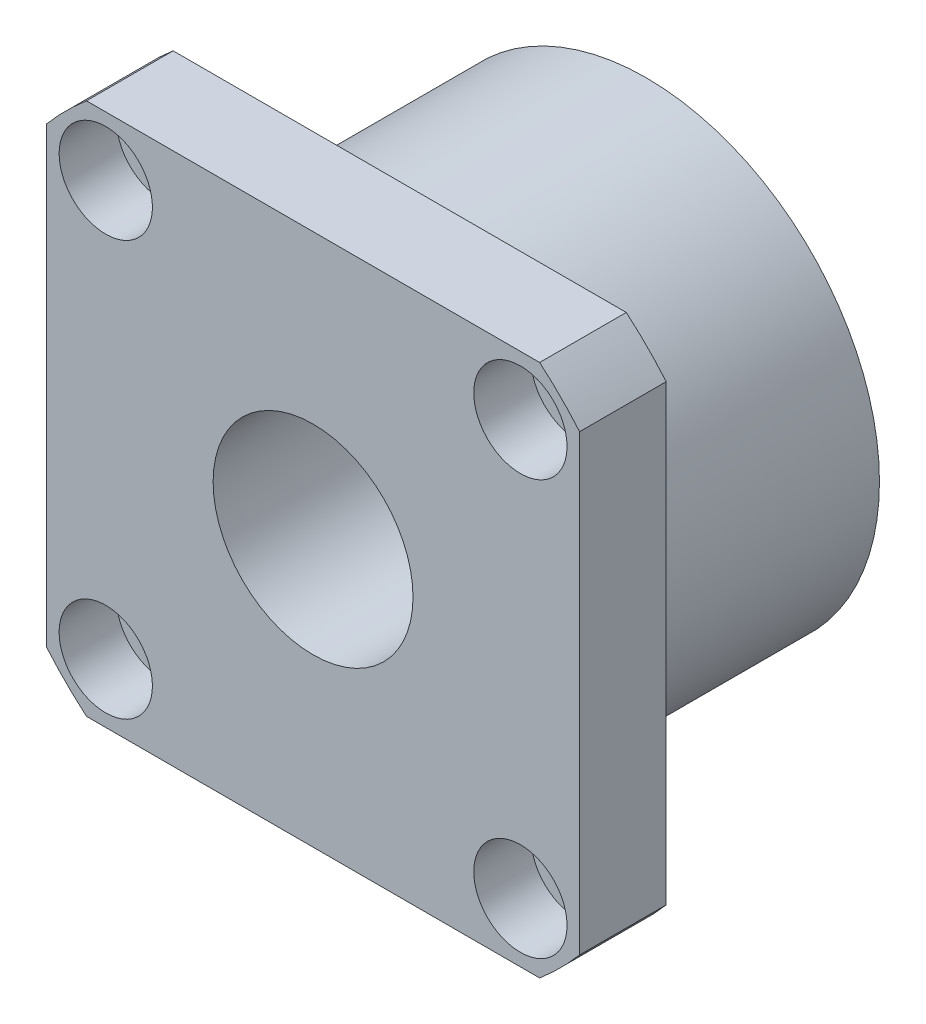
ISO-10303-21;
HEADER;
FILE_DESCRIPTION(('STEP AP214'),'2;1');
FILE_NAME('part.step','',(''),(''),'','','');
FILE_SCHEMA(('AUTOMOTIVE_DESIGN { 1 0 10303 214 1 1 1 1 }'));
ENDSEC;
DATA;
#1=APPLICATION_CONTEXT('core data for automotive mechanical design processes');
#2=APPLICATION_PROTOCOL_DEFINITION('international standard','automotive_design',2000,#1);
#3=PRODUCT_CONTEXT('',#1,'mechanical');
#4=PRODUCT('Part','Part','',(#3));
#5=PRODUCT_RELATED_PRODUCT_CATEGORY('part','',(#4));
#6=PRODUCT_DEFINITION_FORMATION('','',#4);
#7=PRODUCT_DEFINITION_CONTEXT('part definition',#1,'design');
#8=PRODUCT_DEFINITION('design','',#6,#7);
#9=PRODUCT_DEFINITION_SHAPE('','',#8);
#10=(LENGTH_UNIT() NAMED_UNIT(*) SI_UNIT(.MILLI.,.METRE.));
#11=(NAMED_UNIT(*) PLANE_ANGLE_UNIT() SI_UNIT($,.RADIAN.));
#12=(NAMED_UNIT(*) SI_UNIT($,.STERADIAN.) SOLID_ANGLE_UNIT());
#13=UNCERTAINTY_MEASURE_WITH_UNIT(LENGTH_MEASURE(1.E-05),#10,'distance_accuracy_value','');
#14=(GEOMETRIC_REPRESENTATION_CONTEXT(3) GLOBAL_UNCERTAINTY_ASSIGNED_CONTEXT((#13)) GLOBAL_UNIT_ASSIGNED_CONTEXT((#10,
#11,#12)) REPRESENTATION_CONTEXT('',''));
#15=CARTESIAN_POINT('',(0.,0.,0.));
#16=DIRECTION('',(0.,0.,1.));
#17=DIRECTION('',(1.,0.,0.));
#18=AXIS2_PLACEMENT_3D('',#15,#16,#17);
#19=CARTESIAN_POINT('',(0.,0.,0.));
#20=DIRECTION('',(0.,0.,-1.));
#21=DIRECTION('',(-1.,0.,0.));
#22=AXIS2_PLACEMENT_3D('',#19,#20,#21);
#23=PLANE('',#22);
#24=CARTESIAN_POINT('',(-31.1126983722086,-31.1126983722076,0.));
#25=DIRECTION('',(0.,0.,-1.));
#26=DIRECTION('',(0.,-1.,0.));
#27=AXIS2_PLACEMENT_3D('',#24,#25,#26);
#28=CIRCLE('',#27,5.);
#29=CARTESIAN_POINT('',(-31.1126983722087,-36.1126983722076,0.));
#30=VERTEX_POINT('',#29);
#31=EDGE_CURVE('E156',#30,#30,#28,.T.);
#32=ORIENTED_EDGE('',*,*,#31,.F.);
#33=EDGE_LOOP('',(#32));
#34=FACE_BOUND('',#33,.T.);
#35=CARTESIAN_POINT('',(31.1126983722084,31.1126983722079,0.));
#36=DIRECTION('',(0.,0.,-1.));
#37=DIRECTION('',(0.,1.,0.));
#38=AXIS2_PLACEMENT_3D('',#35,#36,#37);
#39=CIRCLE('',#38,5.);
#40=CARTESIAN_POINT('',(31.1126983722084,36.1126983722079,0.));
#41=VERTEX_POINT('',#40);
#42=EDGE_CURVE('E190',#41,#41,#39,.T.);
#43=ORIENTED_EDGE('',*,*,#42,.F.);
#44=EDGE_LOOP('',(#43));
#45=FACE_BOUND('',#44,.T.);
#46=CARTESIAN_POINT('',(0.,0.,0.));
#47=DIRECTION('',(0.,0.,-1.));
#48=DIRECTION('',(-1.,0.,0.));
#49=AXIS2_PLACEMENT_3D('',#46,#47,#48);
#50=CIRCLE('',#49,52.5);
#51=CARTESIAN_POINT('',(40.,-34.0036762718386,0.));
#52=VERTEX_POINT('',#51);
#53=CARTESIAN_POINT('',(34.0036762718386,-40.,0.));
#54=VERTEX_POINT('',#53);
#55=EDGE_CURVE('E80',#52,#54,#50,.T.);
#56=ORIENTED_EDGE('',*,*,#55,.T.);
#57=DIRECTION('',(1.,0.,0.));
#58=VECTOR('',#57,1.);
#59=CARTESIAN_POINT('',(-34.0036762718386,-40.,0.));
#60=LINE('',#59,#58);
#61=CARTESIAN_POINT('',(-34.0036762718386,-40.,0.));
#62=VERTEX_POINT('',#61);
#63=EDGE_CURVE('E94',#62,#54,#60,.T.);
#64=ORIENTED_EDGE('',*,*,#63,.F.);
#65=CARTESIAN_POINT('',(0.,0.,0.));
#66=DIRECTION('',(0.,0.,1.));
#67=DIRECTION('',(1.,0.,0.));
#68=AXIS2_PLACEMENT_3D('',#65,#66,#67);
#69=CIRCLE('',#68,52.5);
#70=CARTESIAN_POINT('',(-40.,-34.0036762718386,0.));
#71=VERTEX_POINT('',#70);
#72=EDGE_CURVE('E101',#71,#62,#69,.T.);
#73=ORIENTED_EDGE('',*,*,#72,.F.);
#74=DIRECTION('',(0.,-1.,0.));
#75=VECTOR('',#74,1.);
#76=CARTESIAN_POINT('',(-40.,34.0036762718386,0.));
#77=LINE('',#76,#75);
#78=CARTESIAN_POINT('',(-40.,34.0036762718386,0.));
#79=VERTEX_POINT('',#78);
#80=EDGE_CURVE('E103',#79,#71,#77,.T.);
#81=ORIENTED_EDGE('',*,*,#80,.F.);
#82=CARTESIAN_POINT('',(0.,0.,0.));
#83=DIRECTION('',(0.,0.,-1.));
#84=DIRECTION('',(-1.,0.,0.));
#85=AXIS2_PLACEMENT_3D('',#82,#83,#84);
#86=CIRCLE('',#85,52.5);
#87=CARTESIAN_POINT('',(-34.0036762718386,40.,0.));
#88=VERTEX_POINT('',#87);
#89=EDGE_CURVE('E109',#79,#88,#86,.T.);
#90=ORIENTED_EDGE('',*,*,#89,.T.);
#91=DIRECTION('',(1.,0.,0.));
#92=VECTOR('',#91,1.);
#93=CARTESIAN_POINT('',(-34.0036762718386,40.,0.));
#94=LINE('',#93,#92);
#95=CARTESIAN_POINT('',(34.0036762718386,40.,0.));
#96=VERTEX_POINT('',#95);
#97=EDGE_CURVE('E112',#88,#96,#94,.T.);
#98=ORIENTED_EDGE('',*,*,#97,.T.);
#99=CARTESIAN_POINT('',(0.,0.,0.));
#100=DIRECTION('',(0.,0.,1.));
#101=DIRECTION('',(1.,0.,0.));
#102=AXIS2_PLACEMENT_3D('',#99,#100,#101);
#103=CIRCLE('',#102,52.5);
#104=CARTESIAN_POINT('',(40.,34.0036762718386,0.));
#105=VERTEX_POINT('',#104);
#106=EDGE_CURVE('E115',#105,#96,#103,.T.);
#107=ORIENTED_EDGE('',*,*,#106,.F.);
#108=DIRECTION('',(0.,-1.,0.));
#109=VECTOR('',#108,1.);
#110=CARTESIAN_POINT('',(40.,34.0036762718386,0.));
#111=LINE('',#110,#109);
#112=EDGE_CURVE('E97',#105,#52,#111,.T.);
#113=ORIENTED_EDGE('',*,*,#112,.T.);
#114=EDGE_LOOP('',(#56,#64,#73,#81,#90,#98,#107,#113));
#115=FACE_BOUND('',#114,.T.);
#116=CARTESIAN_POINT('',(-31.112698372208,31.1126983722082,0.));
#117=DIRECTION('',(0.,0.,-1.));
#118=DIRECTION('',(-1.,0.,0.));
#119=AXIS2_PLACEMENT_3D('',#116,#117,#118);
#120=CIRCLE('',#119,5.);
#121=CARTESIAN_POINT('',(-36.112698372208,31.1126983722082,0.));
#122=VERTEX_POINT('',#121);
#123=EDGE_CURVE('E151',#122,#122,#120,.T.);
#124=ORIENTED_EDGE('',*,*,#123,.F.);
#125=EDGE_LOOP('',(#124));
#126=FACE_BOUND('',#125,.T.);
#127=CARTESIAN_POINT('',(31.1126983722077,-31.1126983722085,0.));
#128=DIRECTION('',(0.,0.,-1.));
#129=DIRECTION('',(1.,0.,0.));
#130=AXIS2_PLACEMENT_3D('',#127,#128,#129);
#131=CIRCLE('',#130,5.);
#132=CARTESIAN_POINT('',(36.1126983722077,-31.1126983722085,0.));
#133=VERTEX_POINT('',#132);
#134=EDGE_CURVE('E187',#133,#133,#131,.T.);
#135=ORIENTED_EDGE('',*,*,#134,.F.);
#136=EDGE_LOOP('',(#135));
#137=FACE_BOUND('',#136,.T.);
#138=CARTESIAN_POINT('',(0.,0.,0.));
#139=DIRECTION('',(0.,0.,-1.));
#140=DIRECTION('',(-1.,0.,0.));
#141=AXIS2_PLACEMENT_3D('',#138,#139,#140);
#142=CIRCLE('',#141,35.);
#143=CARTESIAN_POINT('',(-35.,0.,0.));
#144=VERTEX_POINT('',#143);
#145=EDGE_CURVE('E18',#144,#144,#142,.F.);
#146=ORIENTED_EDGE('',*,*,#145,.T.);
#147=EDGE_LOOP('',(#146));
#148=FACE_BOUND('',#147,.T.);
#149=ADVANCED_FACE('F14',(#34,#45,#115,#126,#137,#148),#23,.T.);
#150=CARTESIAN_POINT('',(0.,0.,13.));
#151=DIRECTION('',(0.,0.,-1.));
#152=DIRECTION('',(-1.,0.,0.));
#153=AXIS2_PLACEMENT_3D('',#150,#151,#152);
#154=PLANE('',#153);
#155=CARTESIAN_POINT('',(0.,0.,13.));
#156=DIRECTION('',(0.,0.,1.));
#157=DIRECTION('',(1.,0.,0.));
#158=AXIS2_PLACEMENT_3D('',#155,#156,#157);
#159=CIRCLE('',#158,15.);
#160=CARTESIAN_POINT('',(15.,0.,13.));
#161=VERTEX_POINT('',#160);
#162=EDGE_CURVE('E98',#161,#161,#159,.T.);
#163=ORIENTED_EDGE('',*,*,#162,.F.);
#164=EDGE_LOOP('',(#163));
#165=FACE_BOUND('',#164,.T.);
#166=CARTESIAN_POINT('',(-31.1126983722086,-31.1126983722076,13.));
#167=DIRECTION('',(0.,0.,-1.));
#168=DIRECTION('',(0.,-1.,0.));
#169=AXIS2_PLACEMENT_3D('',#166,#167,#168);
#170=CIRCLE('',#169,7.);
#171=CARTESIAN_POINT('',(-31.1126983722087,-38.1126983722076,13.));
#172=VERTEX_POINT('',#171);
#173=EDGE_CURVE('E171',#172,#172,#170,.T.);
#174=ORIENTED_EDGE('',*,*,#173,.T.);
#175=EDGE_LOOP('',(#174));
#176=FACE_BOUND('',#175,.T.);
#177=CARTESIAN_POINT('',(31.1126983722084,31.1126983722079,13.));
#178=DIRECTION('',(0.,0.,-1.));
#179=DIRECTION('',(0.,1.,0.));
#180=AXIS2_PLACEMENT_3D('',#177,#178,#179);
#181=CIRCLE('',#180,7.);
#182=CARTESIAN_POINT('',(31.1126983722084,38.1126983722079,13.));
#183=VERTEX_POINT('',#182);
#184=EDGE_CURVE('E160',#183,#183,#181,.T.);
#185=ORIENTED_EDGE('',*,*,#184,.T.);
#186=EDGE_LOOP('',(#185));
#187=FACE_BOUND('',#186,.T.);
#188=CARTESIAN_POINT('',(-31.112698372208,31.1126983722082,13.));
#189=DIRECTION('',(0.,0.,-1.));
#190=DIRECTION('',(-1.,0.,0.));
#191=AXIS2_PLACEMENT_3D('',#188,#189,#190);
#192=CIRCLE('',#191,7.);
#193=CARTESIAN_POINT('',(-38.112698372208,31.1126983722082,13.));
#194=VERTEX_POINT('',#193);
#195=EDGE_CURVE('E193',#194,#194,#192,.T.);
#196=ORIENTED_EDGE('',*,*,#195,.T.);
#197=EDGE_LOOP('',(#196));
#198=FACE_BOUND('',#197,.T.);
#199=CARTESIAN_POINT('',(0.,0.,13.));
#200=DIRECTION('',(0.,0.,-1.));
#201=DIRECTION('',(-1.,0.,0.));
#202=AXIS2_PLACEMENT_3D('',#199,#200,#201);
#203=CIRCLE('',#202,52.5);
#204=CARTESIAN_POINT('',(40.,-34.0036762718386,13.));
#205=VERTEX_POINT('',#204);
#206=CARTESIAN_POINT('',(34.0036762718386,-40.,13.));
#207=VERTEX_POINT('',#206);
#208=EDGE_CURVE('E82',#205,#207,#203,.T.);
#209=ORIENTED_EDGE('',*,*,#208,.F.);
#210=DIRECTION('',(0.,-1.,0.));
#211=VECTOR('',#210,1.);
#212=CARTESIAN_POINT('',(40.,34.0036762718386,13.));
#213=LINE('',#212,#211);
#214=CARTESIAN_POINT('',(40.,34.0036762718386,13.));
#215=VERTEX_POINT('',#214);
#216=EDGE_CURVE('E88',#215,#205,#213,.T.);
#217=ORIENTED_EDGE('',*,*,#216,.F.);
#218=CARTESIAN_POINT('',(0.,0.,13.));
#219=DIRECTION('',(0.,0.,1.));
#220=DIRECTION('',(1.,0.,0.));
#221=AXIS2_PLACEMENT_3D('',#218,#219,#220);
#222=CIRCLE('',#221,52.5);
#223=CARTESIAN_POINT('',(34.0036762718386,40.,13.));
#224=VERTEX_POINT('',#223);
#225=EDGE_CURVE('E134',#215,#224,#222,.T.);
#226=ORIENTED_EDGE('',*,*,#225,.T.);
#227=DIRECTION('',(1.,0.,0.));
#228=VECTOR('',#227,1.);
#229=CARTESIAN_POINT('',(-34.0036762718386,40.,13.));
#230=LINE('',#229,#228);
#231=CARTESIAN_POINT('',(-34.0036762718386,40.,13.));
#232=VERTEX_POINT('',#231);
#233=EDGE_CURVE('E131',#232,#224,#230,.T.);
#234=ORIENTED_EDGE('',*,*,#233,.F.);
#235=CARTESIAN_POINT('',(0.,0.,13.));
#236=DIRECTION('',(0.,0.,-1.));
#237=DIRECTION('',(-1.,0.,0.));
#238=AXIS2_PLACEMENT_3D('',#235,#236,#237);
#239=CIRCLE('',#238,52.5);
#240=CARTESIAN_POINT('',(-40.,34.0036762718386,13.));
#241=VERTEX_POINT('',#240);
#242=EDGE_CURVE('E128',#241,#232,#239,.T.);
#243=ORIENTED_EDGE('',*,*,#242,.F.);
#244=DIRECTION('',(0.,-1.,0.));
#245=VECTOR('',#244,1.);
#246=CARTESIAN_POINT('',(-40.,34.0036762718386,13.));
#247=LINE('',#246,#245);
#248=CARTESIAN_POINT('',(-40.,-34.0036762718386,13.));
#249=VERTEX_POINT('',#248);
#250=EDGE_CURVE('E125',#241,#249,#247,.T.);
#251=ORIENTED_EDGE('',*,*,#250,.T.);
#252=CARTESIAN_POINT('',(0.,0.,13.));
#253=DIRECTION('',(0.,0.,1.));
#254=DIRECTION('',(1.,0.,0.));
#255=AXIS2_PLACEMENT_3D('',#252,#253,#254);
#256=CIRCLE('',#255,52.5);
#257=CARTESIAN_POINT('',(-34.0036762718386,-40.,13.));
#258=VERTEX_POINT('',#257);
#259=EDGE_CURVE('E122',#249,#258,#256,.T.);
#260=ORIENTED_EDGE('',*,*,#259,.T.);
#261=DIRECTION('',(1.,0.,0.));
#262=VECTOR('',#261,1.);
#263=CARTESIAN_POINT('',(-34.0036762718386,-40.,13.));
#264=LINE('',#263,#262);
#265=EDGE_CURVE('E120',#258,#207,#264,.T.);
#266=ORIENTED_EDGE('',*,*,#265,.T.);
#267=EDGE_LOOP('',(#209,#217,#226,#234,#243,#251,#260,#266));
#268=FACE_BOUND('',#267,.T.);
#269=CARTESIAN_POINT('',(31.1126983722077,-31.1126983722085,13.));
#270=DIRECTION('',(0.,0.,-1.));
#271=DIRECTION('',(1.,0.,0.));
#272=AXIS2_PLACEMENT_3D('',#269,#270,#271);
#273=CIRCLE('',#272,7.);
#274=CARTESIAN_POINT('',(38.1126983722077,-31.1126983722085,13.));
#275=VERTEX_POINT('',#274);
#276=EDGE_CURVE('E164',#275,#275,#273,.T.);
#277=ORIENTED_EDGE('',*,*,#276,.T.);
#278=EDGE_LOOP('',(#277));
#279=FACE_BOUND('',#278,.T.);
#280=ADVANCED_FACE('F205',(#165,#176,#187,#198,#268,#279),#154,.F.);
#281=CARTESIAN_POINT('',(0.,0.,13.));
#282=DIRECTION('',(0.,0.,-1.));
#283=DIRECTION('',(-1.,0.,0.));
#284=AXIS2_PLACEMENT_3D('',#281,#282,#283);
#285=CYLINDRICAL_SURFACE('',#284,52.5);
#286=DIRECTION('',(0.,0.,-1.));
#287=VECTOR('',#286,1.);
#288=CARTESIAN_POINT('',(40.,-34.0036762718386,13.));
#289=LINE('',#288,#287);
#290=EDGE_CURVE('E9',#205,#52,#289,.T.);
#291=ORIENTED_EDGE('',*,*,#290,.F.);
#292=ORIENTED_EDGE('',*,*,#208,.T.);
#293=DIRECTION('',(0.,0.,-1.));
#294=VECTOR('',#293,1.);
#295=CARTESIAN_POINT('',(34.0036762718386,-40.,13.));
#296=LINE('',#295,#294);
#297=EDGE_CURVE('E77',#207,#54,#296,.T.);
#298=ORIENTED_EDGE('',*,*,#297,.T.);
#299=ORIENTED_EDGE('',*,*,#55,.F.);
#300=EDGE_LOOP('',(#291,#292,#298,#299));
#301=FACE_BOUND('',#300,.T.);
#302=ADVANCED_FACE('F79',(#301),#285,.T.);
#303=CARTESIAN_POINT('',(40.,34.0036762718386,13.));
#304=DIRECTION('',(1.,0.,0.));
#305=DIRECTION('',(0.,0.,-1.));
#306=AXIS2_PLACEMENT_3D('',#303,#304,#305);
#307=PLANE('',#306);
#308=DIRECTION('',(0.,0.,-1.));
#309=VECTOR('',#308,1.);
#310=CARTESIAN_POINT('',(40.,34.0036762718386,13.));
#311=LINE('',#310,#309);
#312=EDGE_CURVE('E23',#215,#105,#311,.T.);
#313=ORIENTED_EDGE('',*,*,#312,.F.);
#314=ORIENTED_EDGE('',*,*,#216,.T.);
#315=ORIENTED_EDGE('',*,*,#290,.T.);
#316=ORIENTED_EDGE('',*,*,#112,.F.);
#317=EDGE_LOOP('',(#313,#314,#315,#316));
#318=FACE_BOUND('',#317,.T.);
#319=ADVANCED_FACE('F16',(#318),#307,.T.);
#320=CARTESIAN_POINT('',(0.,0.,13.));
#321=DIRECTION('',(0.,0.,-1.));
#322=DIRECTION('',(-1.,0.,0.));
#323=AXIS2_PLACEMENT_3D('',#320,#321,#322);
#324=CYLINDRICAL_SURFACE('',#323,52.5);
#325=DIRECTION('',(0.,0.,-1.));
#326=VECTOR('',#325,1.);
#327=CARTESIAN_POINT('',(34.0036762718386,40.,13.));
#328=LINE('',#327,#326);
#329=EDGE_CURVE('E145',#224,#96,#328,.T.);
#330=ORIENTED_EDGE('',*,*,#329,.F.);
#331=ORIENTED_EDGE('',*,*,#225,.F.);
#332=ORIENTED_EDGE('',*,*,#312,.T.);
#333=ORIENTED_EDGE('',*,*,#106,.T.);
#334=EDGE_LOOP('',(#330,#331,#332,#333));
#335=FACE_BOUND('',#334,.T.);
#336=ADVANCED_FACE('F269',(#335),#324,.T.);
#337=CARTESIAN_POINT('',(-34.0036762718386,40.,13.));
#338=DIRECTION('',(0.,1.,0.));
#339=DIRECTION('',(0.,0.,1.));
#340=AXIS2_PLACEMENT_3D('',#337,#338,#339);
#341=PLANE('',#340);
#342=DIRECTION('',(0.,0.,-1.));
#343=VECTOR('',#342,1.);
#344=CARTESIAN_POINT('',(-34.0036762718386,40.,13.));
#345=LINE('',#344,#343);
#346=EDGE_CURVE('E143',#232,#88,#345,.T.);
#347=ORIENTED_EDGE('',*,*,#346,.F.);
#348=ORIENTED_EDGE('',*,*,#233,.T.);
#349=ORIENTED_EDGE('',*,*,#329,.T.);
#350=ORIENTED_EDGE('',*,*,#97,.F.);
#351=EDGE_LOOP('',(#347,#348,#349,#350));
#352=FACE_BOUND('',#351,.T.);
#353=ADVANCED_FACE('F266',(#352),#341,.T.);
#354=CARTESIAN_POINT('',(0.,0.,13.));
#355=DIRECTION('',(0.,0.,-1.));
#356=DIRECTION('',(-1.,0.,0.));
#357=AXIS2_PLACEMENT_3D('',#354,#355,#356);
#358=CYLINDRICAL_SURFACE('',#357,52.5);
#359=DIRECTION('',(0.,0.,-1.));
#360=VECTOR('',#359,1.);
#361=CARTESIAN_POINT('',(-40.,34.0036762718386,13.));
#362=LINE('',#361,#360);
#363=EDGE_CURVE('E141',#241,#79,#362,.T.);
#364=ORIENTED_EDGE('',*,*,#363,.F.);
#365=ORIENTED_EDGE('',*,*,#242,.T.);
#366=ORIENTED_EDGE('',*,*,#346,.T.);
#367=ORIENTED_EDGE('',*,*,#89,.F.);
#368=EDGE_LOOP('',(#364,#365,#366,#367));
#369=FACE_BOUND('',#368,.T.);
#370=ADVANCED_FACE('F262',(#369),#358,.T.);
#371=CARTESIAN_POINT('',(-40.,34.0036762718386,13.));
#372=DIRECTION('',(1.,0.,0.));
#373=DIRECTION('',(0.,0.,-1.));
#374=AXIS2_PLACEMENT_3D('',#371,#372,#373);
#375=PLANE('',#374);
#376=DIRECTION('',(0.,0.,-1.));
#377=VECTOR('',#376,1.);
#378=CARTESIAN_POINT('',(-40.,-34.0036762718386,13.));
#379=LINE('',#378,#377);
#380=EDGE_CURVE('E139',#249,#71,#379,.T.);
#381=ORIENTED_EDGE('',*,*,#380,.F.);
#382=ORIENTED_EDGE('',*,*,#250,.F.);
#383=ORIENTED_EDGE('',*,*,#363,.T.);
#384=ORIENTED_EDGE('',*,*,#80,.T.);
#385=EDGE_LOOP('',(#381,#382,#383,#384));
#386=FACE_BOUND('',#385,.T.);
#387=ADVANCED_FACE('F258',(#386),#375,.F.);
#388=CARTESIAN_POINT('',(0.,0.,13.));
#389=DIRECTION('',(0.,0.,-1.));
#390=DIRECTION('',(-1.,0.,0.));
#391=AXIS2_PLACEMENT_3D('',#388,#389,#390);
#392=CYLINDRICAL_SURFACE('',#391,52.5);
#393=DIRECTION('',(0.,0.,-1.));
#394=VECTOR('',#393,1.);
#395=CARTESIAN_POINT('',(-34.0036762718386,-40.,13.));
#396=LINE('',#395,#394);
#397=EDGE_CURVE('E87',#258,#62,#396,.T.);
#398=ORIENTED_EDGE('',*,*,#397,.F.);
#399=ORIENTED_EDGE('',*,*,#259,.F.);
#400=ORIENTED_EDGE('',*,*,#380,.T.);
#401=ORIENTED_EDGE('',*,*,#72,.T.);
#402=EDGE_LOOP('',(#398,#399,#400,#401));
#403=FACE_BOUND('',#402,.T.);
#404=ADVANCED_FACE('F255',(#403),#392,.T.);
#405=CARTESIAN_POINT('',(-34.0036762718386,-40.,13.));
#406=DIRECTION('',(0.,1.,0.));
#407=DIRECTION('',(0.,0.,1.));
#408=AXIS2_PLACEMENT_3D('',#405,#406,#407);
#409=PLANE('',#408);
#410=ORIENTED_EDGE('',*,*,#265,.F.);
#411=ORIENTED_EDGE('',*,*,#397,.T.);
#412=ORIENTED_EDGE('',*,*,#63,.T.);
#413=ORIENTED_EDGE('',*,*,#297,.F.);
#414=EDGE_LOOP('',(#410,#411,#412,#413));
#415=FACE_BOUND('',#414,.T.);
#416=ADVANCED_FACE('F100',(#415),#409,.F.);
#417=CARTESIAN_POINT('',(0.,0.,13.));
#418=DIRECTION('',(0.,0.,-1.));
#419=DIRECTION('',(-1.,0.,0.));
#420=AXIS2_PLACEMENT_3D('',#417,#418,#419);
#421=CYLINDRICAL_SURFACE('',#420,15.);
#422=ORIENTED_EDGE('',*,*,#162,.T.);
#423=EDGE_LOOP('',(#422));
#424=FACE_BOUND('',#423,.T.);
#425=CARTESIAN_POINT('',(0.,0.,-37.));
#426=DIRECTION('',(0.,0.,-1.));
#427=DIRECTION('',(-1.,0.,0.));
#428=AXIS2_PLACEMENT_3D('',#425,#426,#427);
#429=CIRCLE('',#428,15.);
#430=CARTESIAN_POINT('',(-15.,0.,-37.));
#431=VERTEX_POINT('',#430);
#432=EDGE_CURVE('E475',#431,#431,#429,.T.);
#433=ORIENTED_EDGE('',*,*,#432,.T.);
#434=EDGE_LOOP('',(#433));
#435=FACE_BOUND('',#434,.T.);
#436=ADVANCED_FACE('F202',(#424,#435),#421,.F.);
#437=CARTESIAN_POINT('',(-31.112698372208,31.1126983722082,0.));
#438=DIRECTION('',(0.,0.,1.));
#439=DIRECTION('',(1.,0.,0.));
#440=AXIS2_PLACEMENT_3D('',#437,#438,#439);
#441=CYLINDRICAL_SURFACE('',#440,5.);
#442=CARTESIAN_POINT('',(-31.112698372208,31.1126983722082,4.4));
#443=DIRECTION('',(0.,0.,-1.));
#444=DIRECTION('',(-1.,0.,0.));
#445=AXIS2_PLACEMENT_3D('',#442,#443,#444);
#446=CIRCLE('',#445,5.);
#447=CARTESIAN_POINT('',(-36.112698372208,31.1126983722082,4.4));
#448=VERTEX_POINT('',#447);
#449=EDGE_CURVE('E148',#448,#448,#446,.T.);
#450=ORIENTED_EDGE('',*,*,#449,.F.);
#451=EDGE_LOOP('',(#450));
#452=FACE_BOUND('',#451,.T.);
#453=ORIENTED_EDGE('',*,*,#123,.T.);
#454=EDGE_LOOP('',(#453));
#455=FACE_BOUND('',#454,.T.);
#456=ADVANCED_FACE('F351',(#452,#455),#441,.F.);
#457=CARTESIAN_POINT('',(-31.112698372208,31.1126983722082,4.4));
#458=DIRECTION('',(0.,0.,1.));
#459=DIRECTION('',(1.,0.,0.));
#460=AXIS2_PLACEMENT_3D('',#457,#458,#459);
#461=CYLINDRICAL_SURFACE('',#460,7.);
#462=CARTESIAN_POINT('',(-31.112698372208,31.1126983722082,4.4));
#463=DIRECTION('',(0.,0.,-1.));
#464=DIRECTION('',(-1.,0.,0.));
#465=AXIS2_PLACEMENT_3D('',#462,#463,#464);
#466=CIRCLE('',#465,7.);
#467=CARTESIAN_POINT('',(-38.112698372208,31.1126983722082,4.4));
#468=VERTEX_POINT('',#467);
#469=EDGE_CURVE('E152',#468,#468,#466,.T.);
#470=ORIENTED_EDGE('',*,*,#469,.T.);
#471=EDGE_LOOP('',(#470));
#472=FACE_BOUND('',#471,.T.);
#473=ORIENTED_EDGE('',*,*,#195,.F.);
#474=EDGE_LOOP('',(#473));
#475=FACE_BOUND('',#474,.T.);
#476=ADVANCED_FACE('F358',(#472,#475),#461,.F.);
#477=CARTESIAN_POINT('',(-31.112698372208,31.1126983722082,4.4));
#478=DIRECTION('',(0.,0.,-1.));
#479=DIRECTION('',(-1.,0.,0.));
#480=AXIS2_PLACEMENT_3D('',#477,#478,#479);
#481=PLANE('',#480);
#482=ORIENTED_EDGE('',*,*,#449,.T.);
#483=EDGE_LOOP('',(#482));
#484=FACE_BOUND('',#483,.T.);
#485=ORIENTED_EDGE('',*,*,#469,.F.);
#486=EDGE_LOOP('',(#485));
#487=FACE_BOUND('',#486,.T.);
#488=ADVANCED_FACE('F360',(#484,#487),#481,.F.);
#489=CARTESIAN_POINT('',(31.1126983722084,31.1126983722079,0.));
#490=DIRECTION('',(0.,0.,1.));
#491=DIRECTION('',(1.,0.,0.));
#492=AXIS2_PLACEMENT_3D('',#489,#490,#491);
#493=CYLINDRICAL_SURFACE('',#492,5.);
#494=CARTESIAN_POINT('',(31.1126983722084,31.1126983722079,4.4));
#495=DIRECTION('',(0.,0.,-1.));
#496=DIRECTION('',(-1.,0.,0.));
#497=AXIS2_PLACEMENT_3D('',#494,#495,#496);
#498=CIRCLE('',#497,5.);
#499=CARTESIAN_POINT('',(26.1126983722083,31.1126983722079,4.4));
#500=VERTEX_POINT('',#499);
#501=EDGE_CURVE('E153',#500,#500,#498,.T.);
#502=ORIENTED_EDGE('',*,*,#501,.F.);
#503=EDGE_LOOP('',(#502));
#504=FACE_BOUND('',#503,.T.);
#505=ORIENTED_EDGE('',*,*,#42,.T.);
#506=EDGE_LOOP('',(#505));
#507=FACE_BOUND('',#506,.T.);
#508=ADVANCED_FACE('F369',(#504,#507),#493,.F.);
#509=CARTESIAN_POINT('',(31.1126983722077,-31.1126983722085,0.));
#510=DIRECTION('',(0.,0.,1.));
#511=DIRECTION('',(1.,0.,0.));
#512=AXIS2_PLACEMENT_3D('',#509,#510,#511);
#513=CYLINDRICAL_SURFACE('',#512,5.);
#514=CARTESIAN_POINT('',(31.1126983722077,-31.1126983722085,4.4));
#515=DIRECTION('',(0.,0.,-1.));
#516=DIRECTION('',(-1.,0.,0.));
#517=AXIS2_PLACEMENT_3D('',#514,#515,#516);
#518=CIRCLE('',#517,5.);
#519=CARTESIAN_POINT('',(26.1126983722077,-31.1126983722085,4.4));
#520=VERTEX_POINT('',#519);
#521=EDGE_CURVE('E158',#520,#520,#518,.T.);
#522=ORIENTED_EDGE('',*,*,#521,.F.);
#523=EDGE_LOOP('',(#522));
#524=FACE_BOUND('',#523,.T.);
#525=ORIENTED_EDGE('',*,*,#134,.T.);
#526=EDGE_LOOP('',(#525));
#527=FACE_BOUND('',#526,.T.);
#528=ADVANCED_FACE('F384',(#524,#527),#513,.F.);
#529=CARTESIAN_POINT('',(-31.1126983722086,-31.1126983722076,0.));
#530=DIRECTION('',(0.,0.,1.));
#531=DIRECTION('',(1.,0.,0.));
#532=AXIS2_PLACEMENT_3D('',#529,#530,#531);
#533=CYLINDRICAL_SURFACE('',#532,5.);
#534=CARTESIAN_POINT('',(-31.1126983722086,-31.1126983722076,4.4));
#535=DIRECTION('',(0.,0.,-1.));
#536=DIRECTION('',(-1.,0.,0.));
#537=AXIS2_PLACEMENT_3D('',#534,#535,#536);
#538=CIRCLE('',#537,5.);
#539=CARTESIAN_POINT('',(-36.1126983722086,-31.1126983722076,4.4));
#540=VERTEX_POINT('',#539);
#541=EDGE_CURVE('E162',#540,#540,#538,.T.);
#542=ORIENTED_EDGE('',*,*,#541,.F.);
#543=EDGE_LOOP('',(#542));
#544=FACE_BOUND('',#543,.T.);
#545=ORIENTED_EDGE('',*,*,#31,.T.);
#546=EDGE_LOOP('',(#545));
#547=FACE_BOUND('',#546,.T.);
#548=ADVANCED_FACE('F237',(#544,#547),#533,.F.);
#549=CARTESIAN_POINT('',(31.1126983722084,31.1126983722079,4.4));
#550=DIRECTION('',(0.,0.,1.));
#551=DIRECTION('',(1.,0.,0.));
#552=AXIS2_PLACEMENT_3D('',#549,#550,#551);
#553=CYLINDRICAL_SURFACE('',#552,7.);
#554=CARTESIAN_POINT('',(31.1126983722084,31.1126983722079,4.4));
#555=DIRECTION('',(0.,0.,-1.));
#556=DIRECTION('',(0.,1.,0.));
#557=AXIS2_PLACEMENT_3D('',#554,#555,#556);
#558=CIRCLE('',#557,7.);
#559=CARTESIAN_POINT('',(31.1126983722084,38.1126983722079,4.4));
#560=VERTEX_POINT('',#559);
#561=EDGE_CURVE('E157',#560,#560,#558,.T.);
#562=ORIENTED_EDGE('',*,*,#561,.T.);
#563=EDGE_LOOP('',(#562));
#564=FACE_BOUND('',#563,.T.);
#565=ORIENTED_EDGE('',*,*,#184,.F.);
#566=EDGE_LOOP('',(#565));
#567=FACE_BOUND('',#566,.T.);
#568=ADVANCED_FACE('F234',(#564,#567),#553,.F.);
#569=CARTESIAN_POINT('',(31.1126983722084,31.1126983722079,4.4));
#570=DIRECTION('',(0.,0.,-1.));
#571=DIRECTION('',(0.,1.,0.));
#572=AXIS2_PLACEMENT_3D('',#569,#570,#571);
#573=PLANE('',#572);
#574=ORIENTED_EDGE('',*,*,#501,.T.);
#575=EDGE_LOOP('',(#574));
#576=FACE_BOUND('',#575,.T.);
#577=ORIENTED_EDGE('',*,*,#561,.F.);
#578=EDGE_LOOP('',(#577));
#579=FACE_BOUND('',#578,.T.);
#580=ADVANCED_FACE('F222',(#576,#579),#573,.F.);
#581=CARTESIAN_POINT('',(31.1126983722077,-31.1126983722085,4.4));
#582=DIRECTION('',(0.,0.,1.));
#583=DIRECTION('',(1.,0.,0.));
#584=AXIS2_PLACEMENT_3D('',#581,#582,#583);
#585=CYLINDRICAL_SURFACE('',#584,7.);
#586=CARTESIAN_POINT('',(31.1126983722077,-31.1126983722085,4.4));
#587=DIRECTION('',(0.,0.,-1.));
#588=DIRECTION('',(1.,0.,0.));
#589=AXIS2_PLACEMENT_3D('',#586,#587,#588);
#590=CIRCLE('',#589,7.);
#591=CARTESIAN_POINT('',(38.1126983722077,-31.1126983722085,4.4));
#592=VERTEX_POINT('',#591);
#593=EDGE_CURVE('E161',#592,#592,#590,.T.);
#594=ORIENTED_EDGE('',*,*,#593,.T.);
#595=EDGE_LOOP('',(#594));
#596=FACE_BOUND('',#595,.T.);
#597=ORIENTED_EDGE('',*,*,#276,.F.);
#598=EDGE_LOOP('',(#597));
#599=FACE_BOUND('',#598,.T.);
#600=ADVANCED_FACE('F219',(#596,#599),#585,.F.);
#601=CARTESIAN_POINT('',(31.1126983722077,-31.1126983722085,4.4));
#602=DIRECTION('',(0.,0.,-1.));
#603=DIRECTION('',(1.,0.,0.));
#604=AXIS2_PLACEMENT_3D('',#601,#602,#603);
#605=PLANE('',#604);
#606=ORIENTED_EDGE('',*,*,#521,.T.);
#607=EDGE_LOOP('',(#606));
#608=FACE_BOUND('',#607,.T.);
#609=ORIENTED_EDGE('',*,*,#593,.F.);
#610=EDGE_LOOP('',(#609));
#611=FACE_BOUND('',#610,.T.);
#612=ADVANCED_FACE('F221',(#608,#611),#605,.F.);
#613=CARTESIAN_POINT('',(-31.1126983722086,-31.1126983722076,4.4));
#614=DIRECTION('',(0.,0.,1.));
#615=DIRECTION('',(1.,0.,0.));
#616=AXIS2_PLACEMENT_3D('',#613,#614,#615);
#617=CYLINDRICAL_SURFACE('',#616,7.);
#618=CARTESIAN_POINT('',(-31.1126983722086,-31.1126983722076,4.4));
#619=DIRECTION('',(0.,0.,-1.));
#620=DIRECTION('',(0.,-1.,0.));
#621=AXIS2_PLACEMENT_3D('',#618,#619,#620);
#622=CIRCLE('',#621,7.);
#623=CARTESIAN_POINT('',(-31.1126983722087,-38.1126983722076,4.4));
#624=VERTEX_POINT('',#623);
#625=EDGE_CURVE('E165',#624,#624,#622,.T.);
#626=ORIENTED_EDGE('',*,*,#625,.T.);
#627=EDGE_LOOP('',(#626));
#628=FACE_BOUND('',#627,.T.);
#629=ORIENTED_EDGE('',*,*,#173,.F.);
#630=EDGE_LOOP('',(#629));
#631=FACE_BOUND('',#630,.T.);
#632=ADVANCED_FACE('F231',(#628,#631),#617,.F.);
#633=CARTESIAN_POINT('',(-31.1126983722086,-31.1126983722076,4.4));
#634=DIRECTION('',(0.,0.,-1.));
#635=DIRECTION('',(0.,-1.,0.));
#636=AXIS2_PLACEMENT_3D('',#633,#634,#635);
#637=PLANE('',#636);
#638=ORIENTED_EDGE('',*,*,#541,.T.);
#639=EDGE_LOOP('',(#638));
#640=FACE_BOUND('',#639,.T.);
#641=ORIENTED_EDGE('',*,*,#625,.F.);
#642=EDGE_LOOP('',(#641));
#643=FACE_BOUND('',#642,.T.);
#644=ADVANCED_FACE('F225',(#640,#643),#637,.F.);
#645=CARTESIAN_POINT('',(0.,0.,-37.));
#646=DIRECTION('',(0.,0.,-1.));
#647=DIRECTION('',(-1.,0.,0.));
#648=AXIS2_PLACEMENT_3D('',#645,#646,#647);
#649=PLANE('',#648);
#650=CARTESIAN_POINT('',(0.,0.,-37.));
#651=DIRECTION('',(0.,0.,-1.));
#652=DIRECTION('',(-1.,0.,0.));
#653=AXIS2_PLACEMENT_3D('',#650,#651,#652);
#654=CIRCLE('',#653,35.);
#655=CARTESIAN_POINT('',(-35.,0.,-37.));
#656=VERTEX_POINT('',#655);
#657=EDGE_CURVE('E474',#656,#656,#654,.T.);
#658=ORIENTED_EDGE('',*,*,#657,.T.);
#659=EDGE_LOOP('',(#658));
#660=FACE_BOUND('',#659,.T.);
#661=ORIENTED_EDGE('',*,*,#432,.F.);
#662=EDGE_LOOP('',(#661));
#663=FACE_BOUND('',#662,.T.);
#664=ADVANCED_FACE('F239',(#660,#663),#649,.T.);
#665=CARTESIAN_POINT('',(0.,0.,-37.));
#666=DIRECTION('',(0.,0.,1.));
#667=DIRECTION('',(1.,0.,0.));
#668=AXIS2_PLACEMENT_3D('',#665,#666,#667);
#669=CYLINDRICAL_SURFACE('',#668,35.);
#670=ORIENTED_EDGE('',*,*,#145,.F.);
#671=EDGE_LOOP('',(#670));
#672=FACE_BOUND('',#671,.T.);
#673=ORIENTED_EDGE('',*,*,#657,.F.);
#674=EDGE_LOOP('',(#673));
#675=FACE_BOUND('',#674,.T.);
#676=ADVANCED_FACE('F426',(#672,#675),#669,.T.);
#677=CLOSED_SHELL('',(#149,#280,#302,#319,#336,#353,#370,#387,#404,#416,#436,#456,#476,#488,
#508,#528,#548,#568,#580,#600,#612,#632,#644,#664,#676));
#678=MANIFOLD_SOLID_BREP('B1',#677);
#679=ADVANCED_BREP_SHAPE_REPRESENTATION('',(#18,#678),#14);
#680=SHAPE_DEFINITION_REPRESENTATION(#9,#679);
ENDSEC;
END-ISO-10303-21;
